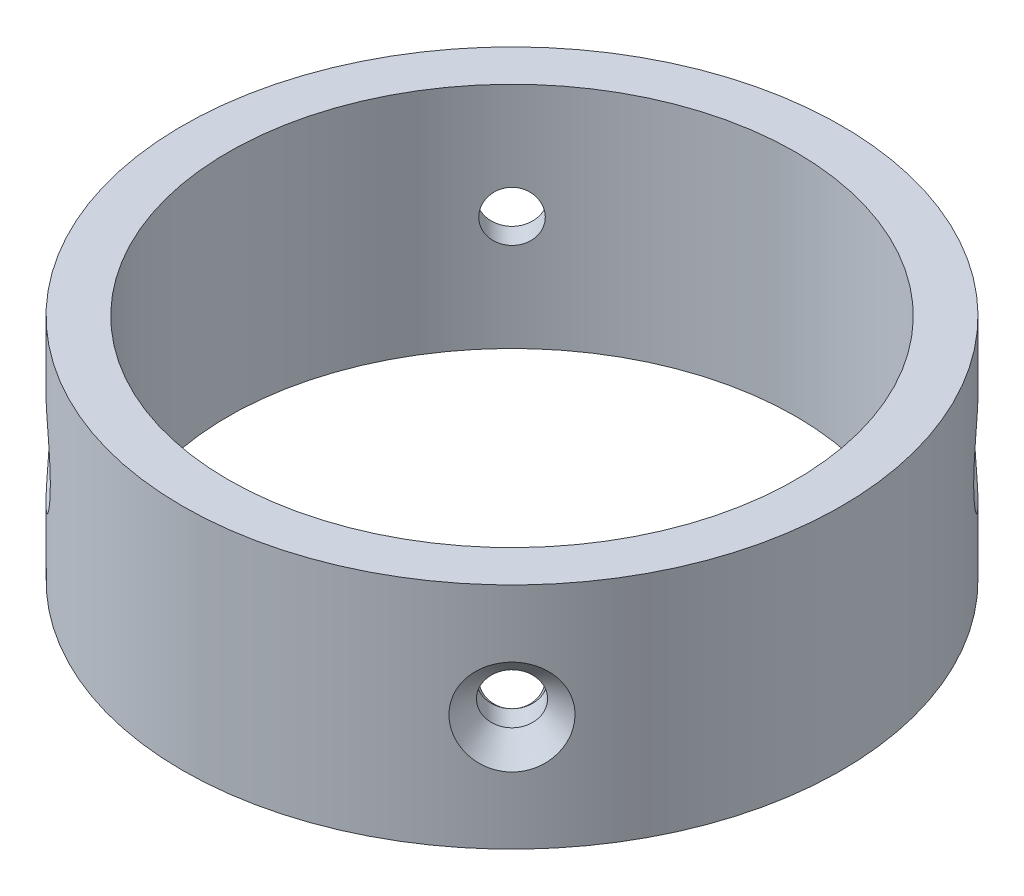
from build123d import *

# Parameters (mm, degrees)
ESQUISSE1_R                  = 36
ESQUISSE1_R_2                = 31
BOSS_EXTRU_1_DEPTH           = 25
R_P_TITION_CIRCULAIRE3_COUNT = 4


with BuildPart() as part:
    # Esquisse1 → Boss.-Extru.1 (new body)
    with BuildSketch(Plane(origin=(0, 0, 0), x_dir=(1, 0, 0), z_dir=(0, 1, 0))):
        with Locations(Location((0, 0, 0), (0, 0, 270))):
            Circle(ESQUISSE1_R)
        with Locations(Location((0, 0, 0), (0, 0, 270))):
            Circle(ESQUISSE1_R_2, mode=Mode.SUBTRACT)
    extrude(amount=BOSS_EXTRU_1_DEPTH)

    # Esquisse6 → Fraisage pour vis _ t_te frais_e M51 (revolve, cut)
    with BuildSketch(Plane(origin=(25.455844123, 12.5, 25.455844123), x_dir=(0.7071067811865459, 0, -0.7071067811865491), z_dir=(0, 1, 0))):
        Polygon((0, 0), (0, 6.652366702), (2.75, 5), (2.75, 2.45), (5.2, 0), align=None)
    fraisage_pour_vis_t_te_frais_e_m51 = revolve(axis=Axis((29.945972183, 12.5, 29.945972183), (-0.7071067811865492, 0, -0.7071067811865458)), mode=Mode.SUBTRACT)

    # R_p_tition circulaire3: Fraisage pour vis _ t_te frais_e M51 ×4 about axis
    r_p_tition_circulaire3_axis = Axis((0, 25, 0), (0, -1, 0))
    for i in range(1, R_P_TITION_CIRCULAIRE3_COUNT):
        add(fraisage_pour_vis_t_te_frais_e_m51.rotate(r_p_tition_circulaire3_axis, i * 360 / R_P_TITION_CIRCULAIRE3_COUNT), mode=Mode.SUBTRACT)


solid = part.part
